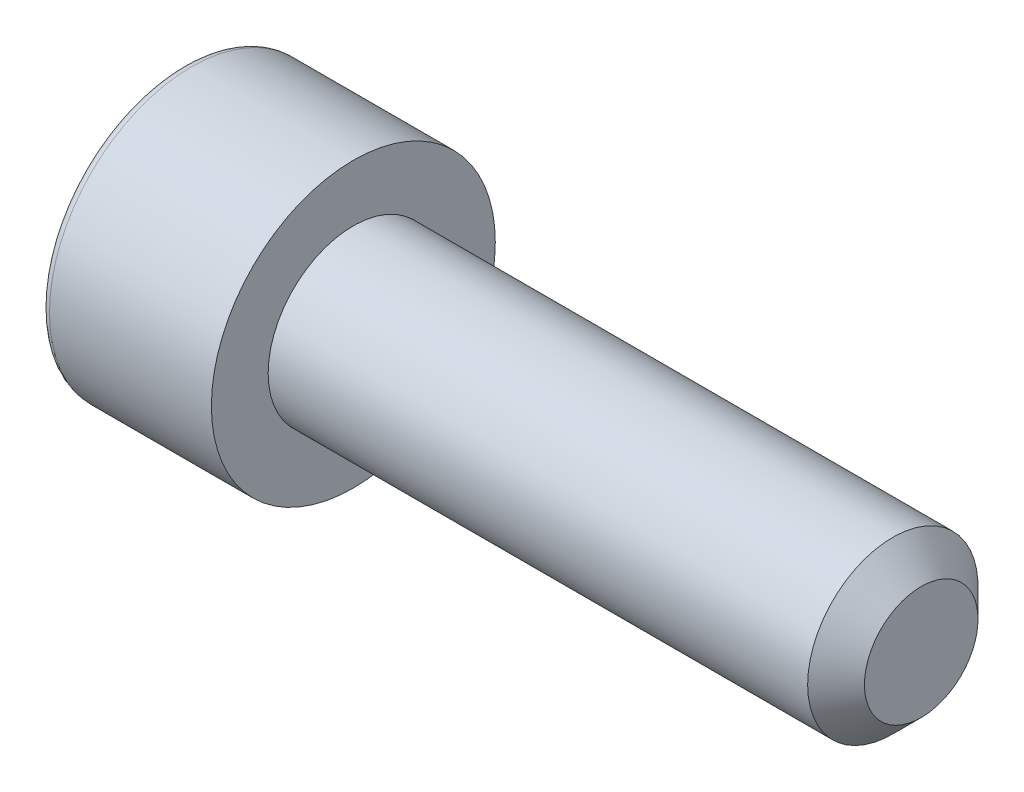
from build123d import *

# Parameters (mm, degrees)
FILLET2_R   = 0.3
HEX_2_DEPTH = 3


with BuildPart() as part:
    # BodySke → Base-Revolve (revolve)
    with BuildSketch(Plane.XY, mode=Mode.PRIVATE) as base_revolve_sk:
        Polygon((0, 0), (0, 5), (6, 5), (6, 3), (25, 3), (26, 2), (26, 0), align=None)
    revolve(base_revolve_sk.sketch.rotate(Axis((-31.75, 0, 0), (1, 0, 0)), 90), axis=Axis((-31.75, 0, 0), (1, 0, 0)))

    # Fillet2
    fillet2_edges = [part.edges().sort_by_distance(p)[0] for p in [
        (0, 0, -5),
    ]]
    fillet(fillet2_edges, radius=FILLET2_R)

    # Sketch2 → Hex-PreBroach (revolve, cut)
    with BuildSketch(Plane.XY, mode=Mode.PRIVATE) as hex_prebroach_sk:
        Polygon((0, 2.542), (3, 2.542), (4.467624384, 0), (0, 0), align=None)
    revolve(hex_prebroach_sk.sketch.rotate(Axis((0, 0, 0), (1, 0, 0)), 90), axis=Axis((0, 0, 0), (1, 0, 0)), mode=Mode.SUBTRACT)

    # Sketch3 → Hex 2 (cut)
    with BuildSketch(Plane(origin=(0, 0, 0), x_dir=(0, 0.500000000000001, 0.866025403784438), z_dir=(-1, 0, 0))):
        Polygon((1.467624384, 2.542), (-1.467624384, 2.542), (-2.935248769, 0), (-1.467624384, -2.542), (1.467624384, -2.542), (2.935248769, 0), align=None)
    extrude(amount=-HEX_2_DEPTH, mode=Mode.SUBTRACT)


solid = part.part
